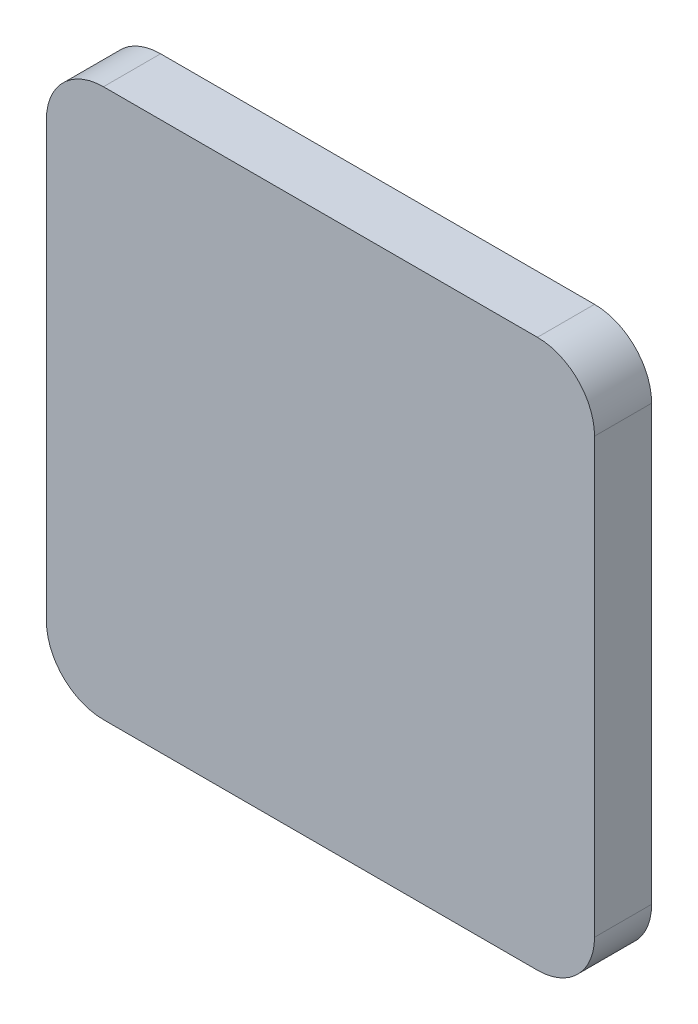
from build123d import *

# Parameters (mm, degrees)
BASE_EXTRUSION_DEPTH = 10


with BuildPart() as part:
    # Esquisse1 → Base-Extrusion (new body)
    with BuildSketch(Plane.XY):
        with BuildLine():
            Line((3598.880972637, 8), (3674.880972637, 8))
            ThreePointArc((3674.880972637, 8), (3681.952040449, 5.071067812), (3684.880972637, -2))
            Line((3684.880972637, -2), (3684.880972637, -78))
            ThreePointArc((3684.880972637, -78), (3681.952040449, -85.071067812), (3674.880972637, -88))
            Line((3674.880972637, -88), (3598.880972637, -88))
            ThreePointArc((3598.880972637, -88), (3591.809904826, -85.071067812), (3588.880972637, -78))
            Line((3588.880972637, -78), (3588.880972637, -2))
            ThreePointArc((3588.880972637, -2), (3591.809904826, 5.071067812), (3598.880972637, 8))
        make_face()
    extrude(amount=BASE_EXTRUSION_DEPTH)


solid = part.part
